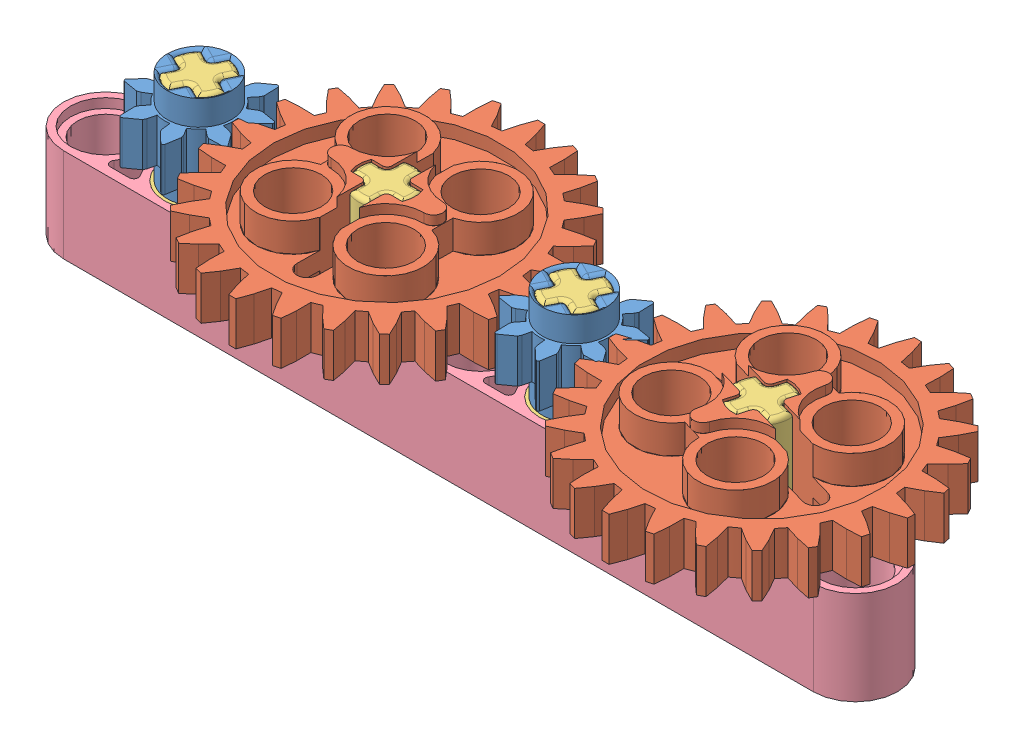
SolidWorks assembly Assem2.sldasm, configuration Default (file format 12000). Lengths in mm.
Overall size (75.78 16 32.37).
9 component instances, 4 part files, 23 mates.
Components (placement in the parent):
- 3647 Gear 8-1: 3647 Gear 8.SLDPRT [Default] at (-8.663 -2.4301 13.7061) x (-0.896308 0 -0.443433) z (0.443433 0 -0.896308) size (10.06 8 10.06)
- 3648 Gear 24-1: 3648 Gear 24.SLDPRT [Default] at (7.337 -2.4301 13.7061) x (-0.010829 0 0.999941) z (-0.999941 0 -0.010829) size (26.1 8 26.1)
- 3749 Axle Pin without Friction Ridges Lengthwise-1: 3749 Axle Pin without Friction Ridges Lengthwise.SLDPRT [Default] at (-8.663 -6.4301 13.7061) x (0.896308 0 0.443433) z (-0.443433 0 0.896308) size (6 16 6)
- 40490 Beam 9 Red-1: 40490 Beam 9 Red.SLDPRT [Default] at (-16.663 -14.4301 13.7061) size (71.2 8 7.2)
- 3749 Axle Pin without Friction Ridges Lengthwise-2: 3749 Axle Pin without Friction Ridges Lengthwise.SLDPRT [Default] at (7.337 -6.4301 13.7061) x (-0.999941 0 -0.010829) z (0.010829 0 -0.999941) size (6 16 6)
- 3749 Axle Pin without Friction Ridges Lengthwise-3: 3749 Axle Pin without Friction Ridges Lengthwise.SLDPRT [Default] at (23.337 -6.4301 13.7061) x (0.896308 0 0.443433) z (-0.443433 0 0.896308) size (6 16 6)
- 3749 Axle Pin without Friction Ridges Lengthwise-4: 3749 Axle Pin without Friction Ridges Lengthwise.SLDPRT [Default] at (39.337 -6.4301 13.7061) x (-0.959956 0 -0.28015) z (0.28015 0 -0.959956) size (6 16 6)
- 3647 Gear 8-2: 3647 Gear 8.SLDPRT [Default] at (23.337 -2.4301 13.7061) x (0.443433 0 -0.896308) z (0.896308 0 0.443433) size (10.06 8 10.06)
- 3648 Gear 24-2: 3648 Gear 24.SLDPRT [Default] at (39.337 -2.4301 13.7061) x (0.959956 0 0.28015) z (-0.28015 0 0.959956) size (26.1 8 26.1)
Mates (geometry in assembly coordinates):
- Concentric1: concentric anti-aligned: cylinder of 3749 Axle Pin without Friction Ridges Lengthwise-1 through (-8.663 -14.4301 13.7061) axis (0 1 0) radius 2.4; cylinder of 40490 Beam 9 Red-1 through (-8.663 -6.4301 13.7061) axis (0 -1 0) radius 2.4
- Concentric2: concentric anti-aligned: cylinder of 40490 Beam 9 Red-1 through (7.337 -6.4301 13.7061) axis (0 -1 0) radius 2.4; cylinder of 3749 Axle Pin without Friction Ridges Lengthwise-2 through (7.337 -14.4301 13.7061) axis (0 1 0) radius 2.4
- Concentric3: concentric anti-aligned: cylinder of 40490 Beam 9 Red-1 through (23.337 -6.4301 13.7061) axis (0 -1 0) radius 2.4; cylinder of 3749 Axle Pin without Friction Ridges Lengthwise-3 through (23.337 -14.4301 13.7061) axis (0 1 0) radius 2.4
- Concentric4: concentric anti-aligned: cylinder of 40490 Beam 9 Red-1 through (39.337 -6.4301 13.7061) axis (0 -1 0) radius 2.4; cylinder of 3749 Axle Pin without Friction Ridges Lengthwise-4 through (39.337 -14.4301 13.7061) axis (0 1 0) radius 2.4
- Coincident2: coincident anti-aligned: plane of 3749 Axle Pin without Friction Ridges Lengthwise-1 through (-8.663 -7.2301 13.7061) normal (0 -1 0); plane of 40490 Beam 9 Red-1 through (-8.663 -7.2301 13.7061) normal (0 1 0)
- Coincident3: coincident anti-aligned: plane of 40490 Beam 9 Red-1 through (7.337 -7.2301 13.7061) normal (0 1 0); plane of 3749 Axle Pin without Friction Ridges Lengthwise-2 through (7.337 -7.2301 13.7061) normal (0 -1 0)
- Coincident4: coincident anti-aligned: plane of 40490 Beam 9 Red-1 through (23.337 -7.2301 13.7061) normal (0 1 0); plane of 3749 Axle Pin without Friction Ridges Lengthwise-3 through (23.337 -7.2301 13.7061) normal (0 -1 0)
- Coincident5: coincident anti-aligned: plane of 40490 Beam 9 Red-1 through (39.337 -7.2301 13.7061) normal (0 1 0); plane of 3749 Axle Pin without Friction Ridges Lengthwise-4 through (39.337 -7.2301 13.7061) normal (0 -1 0)
- Concentric5: concentric anti-aligned: cylinder of 3647 Gear 8-1 through (-8.663 -6.4301 13.7061) axis (0 1 0) radius 2.4; cylinder of 3749 Axle Pin without Friction Ridges Lengthwise-1 through (-8.663 1.5699 13.7061) axis (0 -1 0) radius 2.4
- Coincident6: coincident anti-aligned: plane of 3647 Gear 8-1 through (-9.0773 -6.4301 15.2031) normal (0.945314 0 -0.326161); plane of 3749 Axle Pin without Friction Ridges Lengthwise-1 through (-9.0773 1.5699 15.2031) normal (-0.945314 0 0.326161)
- Coincident7: coincident anti-aligned: plane of 3647 Gear 8-1 through (-8.663 -6.4301 13.7061) normal (0 -1 0); plane of 40490 Beam 9 Red-1 through (-16.663 -6.4301 13.7061) normal (0 1 0)
- Concentric6: concentric anti-aligned: cylinder of 3648 Gear 24-1 through (7.337 -6.4301 13.7061) axis (0 1 0) radius 2.4; cylinder of 3749 Axle Pin without Friction Ridges Lengthwise-2 through (7.337 1.5699 13.7061) axis (0 -1 0) radius 2.4
- Coincident8: coincident anti-aligned: plane of 3648 Gear 24-1 through (8.849 -6.4301 13.3501) normal (-0.362624 0 0.931935); plane of 3749 Axle Pin without Friction Ridges Lengthwise-2 through (6.4633 1.5699 12.4218) normal (0.362624 0 -0.931935)
- Coincident9: coincident anti-aligned: plane of 3648 Gear 24-1 through (11.061 -6.4301 15.1153) normal (0 -1 0); plane of 40490 Beam 9 Red-1 through (-16.663 -6.4301 13.7061) normal (0 1 0)
- Concentric7: concentric anti-aligned: cylinder of 3749 Axle Pin without Friction Ridges Lengthwise-3 through (23.337 1.5699 13.7061) axis (0 -1 0) radius 2.4; cylinder of 3647 Gear 8-2 through (23.337 -6.4301 13.7061) axis (0 1 0) radius 2.4
- Coincident10: coincident anti-aligned: plane of 3749 Axle Pin without Friction Ridges Lengthwise-3 through (22.9227 1.5699 15.2031) normal (-0.945314 0 0.326161); plane of 3647 Gear 8-2 through (21.7769 -6.4301 11.8823) normal (0.945314 0 -0.326161)
- Coincident11: coincident anti-aligned: plane of 40490 Beam 9 Red-1 through (-16.663 -6.4301 13.7061) normal (0 1 0); plane of 3647 Gear 8-2 through (23.337 -6.4301 13.7061) normal (0 -1 0)
- Concentric8: concentric anti-aligned: cylinder of 3749 Axle Pin without Friction Ridges Lengthwise-4 through (39.337 1.5699 13.7061) axis (0 -1 0) radius 2.4; cylinder of 3648 Gear 24-2 through (39.337 -6.4301 13.7061) axis (0 1 0) radius 2.4
- Coincident12: coincident anti-aligned: plane of 3749 Axle Pin without Friction Ridges Lengthwise-4 through (39.9744 1.5699 11.3922) normal (-0.799579 0 -0.600561); plane of 3648 Gear 24-2 through (39.4021 -6.4301 12.1541) normal (0.799579 0 0.600561)
- Coincident13: coincident anti-aligned: plane of 40490 Beam 9 Red-1 through (-16.663 -6.4301 13.7061) normal (0 1 0); plane of 3648 Gear 24-2 through (41.6985 -6.4301 10.5003) normal (0 -1 0)
- GearMate1: gear = 21.5 mm: circle of 3647 Gear 8-1; circle of 3648 Gear 24-1
- GearMate2: gear = 5.865 mm: circle of 3648 Gear 24-1; circle of 3647 Gear 8-2
- GearMate3: gear = 21.5 mm: circle of 3647 Gear 8-2; circle of 3648 Gear 24-2
